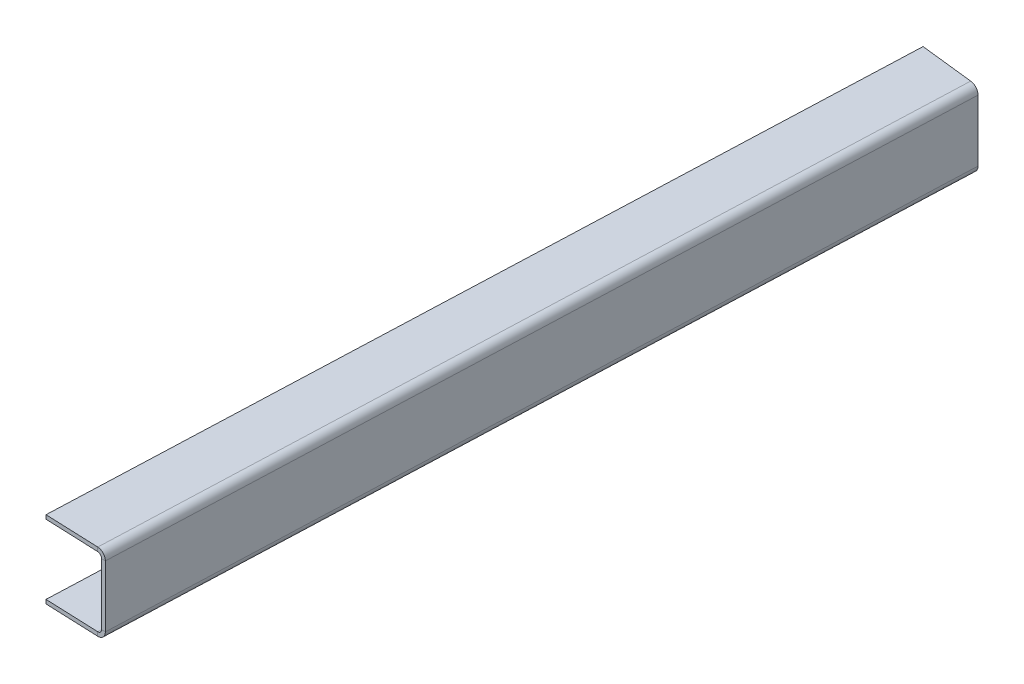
ISO-10303-21;
HEADER;
FILE_DESCRIPTION(('STEP AP214'),'2;1');
FILE_NAME('part.step','',(''),(''),'','','');
FILE_SCHEMA(('AUTOMOTIVE_DESIGN { 1 0 10303 214 1 1 1 1 }'));
ENDSEC;
DATA;
#1=APPLICATION_CONTEXT('core data for automotive mechanical design processes');
#2=APPLICATION_PROTOCOL_DEFINITION('international standard','automotive_design',2000,#1);
#3=PRODUCT_CONTEXT('',#1,'mechanical');
#4=PRODUCT('Part','Part','',(#3));
#5=PRODUCT_RELATED_PRODUCT_CATEGORY('part','',(#4));
#6=PRODUCT_DEFINITION_FORMATION('','',#4);
#7=PRODUCT_DEFINITION_CONTEXT('part definition',#1,'design');
#8=PRODUCT_DEFINITION('design','',#6,#7);
#9=PRODUCT_DEFINITION_SHAPE('','',#8);
#10=(LENGTH_UNIT() NAMED_UNIT(*) SI_UNIT(.MILLI.,.METRE.));
#11=(NAMED_UNIT(*) PLANE_ANGLE_UNIT() SI_UNIT($,.RADIAN.));
#12=(NAMED_UNIT(*) SI_UNIT($,.STERADIAN.) SOLID_ANGLE_UNIT());
#13=UNCERTAINTY_MEASURE_WITH_UNIT(LENGTH_MEASURE(1.E-05),#10,'distance_accuracy_value','');
#14=(GEOMETRIC_REPRESENTATION_CONTEXT(3) GLOBAL_UNCERTAINTY_ASSIGNED_CONTEXT((#13)) GLOBAL_UNIT_ASSIGNED_CONTEXT((#10,
#11,#12)) REPRESENTATION_CONTEXT('',''));
#15=CARTESIAN_POINT('',(0.,0.,0.));
#16=DIRECTION('',(0.,0.,1.));
#17=DIRECTION('',(1.,0.,0.));
#18=AXIS2_PLACEMENT_3D('',#15,#16,#17);
#19=CARTESIAN_POINT('',(1677.65806486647,-4.76152653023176E-13,-594.477985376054));
#20=DIRECTION('',(0.0392134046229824,0.,-0.999230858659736));
#21=DIRECTION('',(0.,1.,0.));
#22=AXIS2_PLACEMENT_3D('',#19,#20,#21);
#23=PLANE('',#22);
#24=DIRECTION('',(-0.999230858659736,0.,-0.0392134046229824));
#25=VECTOR('',#24,1.);
#26=CARTESIAN_POINT('',(1677.65806486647,-28.4988000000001,-594.477985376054));
#27=LINE('',#26,#25);
#28=CARTESIAN_POINT('',(1679.2824145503,-28.4988000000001,-594.414240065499));
#29=VERTEX_POINT('',#28);
#30=CARTESIAN_POINT('',(1677.65806486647,-28.4988000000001,-594.477985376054));
#31=VERTEX_POINT('',#30);
#32=EDGE_CURVE('E12',#29,#31,#27,.T.);
#33=ORIENTED_EDGE('',*,*,#32,.F.);
#34=DIRECTION('',(0.,1.,0.));
#35=VECTOR('',#34,1.);
#36=CARTESIAN_POINT('',(1679.2824145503,-4.76726766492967E-13,-594.414240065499));
#37=LINE('',#36,#35);
#38=CARTESIAN_POINT('',(1679.2824145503,-3.25120000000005,-594.414240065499));
#39=VERTEX_POINT('',#38);
#40=EDGE_CURVE('E137',#29,#39,#37,.T.);
#41=ORIENTED_EDGE('',*,*,#40,.T.);
#42=DIRECTION('',(-0.999230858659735,0.,-0.0392134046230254));
#43=VECTOR('',#42,1.);
#44=CARTESIAN_POINT('',(1677.65806486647,-3.25120000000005,-594.477985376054));
#45=LINE('',#44,#43);
#46=CARTESIAN_POINT('',(1677.65806486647,-3.25120000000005,-594.477985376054));
#47=VERTEX_POINT('',#46);
#48=EDGE_CURVE('E90',#39,#47,#45,.T.);
#49=ORIENTED_EDGE('',*,*,#48,.T.);
#50=DIRECTION('',(0.,1.,0.));
#51=VECTOR('',#50,1.);
#52=CARTESIAN_POINT('',(1677.65806486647,-4.76152653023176E-13,-594.477985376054));
#53=LINE('',#52,#51);
#54=EDGE_CURVE('E139',#31,#47,#53,.T.);
#55=ORIENTED_EDGE('',*,*,#54,.F.);
#56=EDGE_LOOP('',(#33,#41,#49,#55));
#57=FACE_BOUND('',#56,.T.);
#58=ADVANCED_FACE('F78',(#57),#23,.F.);
#59=CARTESIAN_POINT('',(1674.40943663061,-3.25120000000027,-594.607288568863));
#60=CARTESIAN_POINT('',(1673.867986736,-3.25120000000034,-594.628537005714));
#61=CARTESIAN_POINT('',(1673.32653684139,-3.25120000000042,-594.649785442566));
#62=CARTESIAN_POINT('',(1672.78508694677,-3.25120000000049,-594.671033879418));
#63=CARTESIAN_POINT('',(1674.40943663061,-6.50240000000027,-594.607288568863));
#64=CARTESIAN_POINT('',(1673.867986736,-7.58613333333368,-594.628537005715));
#65=CARTESIAN_POINT('',(1673.32653684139,-8.66986666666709,-594.649785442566));
#66=CARTESIAN_POINT('',(1672.78508694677,-9.75360000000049,-594.671033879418));
#67=CARTESIAN_POINT('',(1677.65806486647,-6.50239999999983,-594.477985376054));
#68=CARTESIAN_POINT('',(1678.19951476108,-7.5861333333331,-594.456736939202));
#69=CARTESIAN_POINT('',(1678.74096465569,-8.66986666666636,-594.435488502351));
#70=CARTESIAN_POINT('',(1679.28241455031,-9.75359999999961,-594.414240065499));
#71=CARTESIAN_POINT('',(1677.65806486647,-3.25119999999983,-594.477985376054));
#72=CARTESIAN_POINT('',(1678.19951476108,-3.25119999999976,-594.456736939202));
#73=CARTESIAN_POINT('',(1678.74096465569,-3.25119999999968,-594.435488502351));
#74=CARTESIAN_POINT('',(1679.2824145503,-3.25119999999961,-594.414240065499));
#75=CARTESIAN_POINT('',(1677.65806486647,1.70436581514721E-13,-594.477985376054));
#76=CARTESIAN_POINT('',(1678.19951476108,1.08373333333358,-594.456736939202));
#77=CARTESIAN_POINT('',(1678.74096465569,2.16746666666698,-594.435488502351));
#78=CARTESIAN_POINT('',(1679.2824145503,3.25120000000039,-594.414240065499));
#79=CARTESIAN_POINT('',(1674.40943663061,-2.69315819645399E-13,-594.607288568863));
#80=CARTESIAN_POINT('',(1673.867986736,1.08373333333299,-594.628537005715));
#81=CARTESIAN_POINT('',(1673.32653684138,2.16746666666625,-594.649785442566));
#82=CARTESIAN_POINT('',(1672.78508694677,3.25119999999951,-594.671033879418));
#83=CARTESIAN_POINT('',(1674.40943663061,-3.25120000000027,-594.607288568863));
#84=CARTESIAN_POINT('',(1673.867986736,-3.25120000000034,-594.628537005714));
#85=CARTESIAN_POINT('',(1673.32653684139,-3.25120000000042,-594.649785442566));
#86=CARTESIAN_POINT('',(1672.78508694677,-3.25120000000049,-594.671033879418));
#87=(BOUNDED_SURFACE() B_SPLINE_SURFACE(3,3,((#59,#60,#61,#62),(#63,#64,#65,#66),(#67,#68,#69,
#70),(#71,#72,#73,#74),(#75,#76,#77,#78),(#79,#80,#81,#82),(#83,#84,#85,#86)),.UNSPECIFIED.,.T.,
.F.,.F.) B_SPLINE_SURFACE_WITH_KNOTS((4,3,4),(4,4),(0.,0.5,1.),(0.,1.),
.UNSPECIFIED.) GEOMETRIC_REPRESENTATION_ITEM() RATIONAL_B_SPLINE_SURFACE(((1.,1.,1.,1.),
(0.333333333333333,0.333333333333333,0.333333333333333,0.333333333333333),(0.333333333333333,
0.333333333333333,0.333333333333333,0.333333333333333),(1.,1.,1.,1.),(0.333333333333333,
0.333333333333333,0.333333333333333,0.333333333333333),(0.333333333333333,0.333333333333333,
0.333333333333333,0.333333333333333),(1.,1.,1.,1.))) REPRESENTATION_ITEM('') SURFACE());
#88=CARTESIAN_POINT('',(1676.03375074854,-3.25120000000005,-594.542636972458));
#89=DIRECTION('',(-0.0394921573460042,0.,0.999219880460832));
#90=DIRECTION('',(-0.999219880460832,-1.35258484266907E-13,-0.0394921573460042));
#91=AXIS2_PLACEMENT_3D('',#88,#89,#90);
#92=ELLIPSE('',#91,3.25120012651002,3.2512);
#93=CARTESIAN_POINT('',(1676.03375074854,0.,-594.542636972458));
#94=VERTEX_POINT('',#93);
#95=EDGE_CURVE('E215',#39,#94,#92,.T.);
#96=DIRECTION('',(0.,-1.,0.));
#97=VECTOR('',#96,1.);
#98=CARTESIAN_POINT('',(1676.03375074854,-1.62560000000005,-594.542636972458));
#99=LINE('',#98,#97);
#100=CARTESIAN_POINT('',(1676.03375074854,-1.62560000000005,-594.542636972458));
#101=VERTEX_POINT('',#100);
#102=EDGE_CURVE('E205',#94,#101,#99,.T.);
#103=CARTESIAN_POINT('',(1676.03375074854,-3.25120000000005,-594.542636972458));
#104=DIRECTION('',(-0.0397709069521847,0.,0.999208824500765));
#105=DIRECTION('',(-0.999208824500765,-1.35321803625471E-13,-0.0397709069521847));
#106=AXIS2_PLACEMENT_3D('',#103,#104,#105);
#107=ELLIPSE('',#106,1.62560025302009,1.6256);
#108=EDGE_CURVE('E213',#47,#101,#107,.T.);
#109=ORIENTED_EDGE('',*,*,#48,.F.);
#110=ORIENTED_EDGE('',*,*,#95,.T.);
#111=ORIENTED_EDGE('',*,*,#102,.T.);
#112=ORIENTED_EDGE('',*,*,#108,.F.);
#113=EDGE_LOOP('',(#109,#110,#111,#112));
#114=FACE_BOUND('',#113,.T.);
#115=ADVANCED_FACE('F212',(#114),#87,.F.);
#116=CARTESIAN_POINT('',(1653.89808023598,-1.62560000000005,-595.423689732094));
#117=DIRECTION('',(-0.0397709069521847,0.,0.999208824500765));
#118=DIRECTION('',(0.999208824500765,0.,0.0397709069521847));
#119=AXIS2_PLACEMENT_3D('',#116,#117,#118);
#120=PLANE('',#119);
#121=ORIENTED_EDGE('',*,*,#102,.F.);
#122=DIRECTION('',(0.999208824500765,0.,0.0397709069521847));
#123=VECTOR('',#122,1.);
#124=CARTESIAN_POINT('',(1653.89808023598,0.,-595.423689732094));
#125=LINE('',#124,#123);
#126=CARTESIAN_POINT('',(1653.89808023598,0.,-595.423689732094));
#127=VERTEX_POINT('',#126);
#128=EDGE_CURVE('E176',#127,#94,#125,.T.);
#129=ORIENTED_EDGE('',*,*,#128,.F.);
#130=DIRECTION('',(0.,-1.,0.));
#131=VECTOR('',#130,1.);
#132=CARTESIAN_POINT('',(1653.89808023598,-1.62560000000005,-595.423689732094));
#133=LINE('',#132,#131);
#134=CARTESIAN_POINT('',(1653.89808023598,-1.62560000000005,-595.423689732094));
#135=VERTEX_POINT('',#134);
#136=EDGE_CURVE('E202',#127,#135,#133,.T.);
#137=ORIENTED_EDGE('',*,*,#136,.T.);
#138=DIRECTION('',(0.999208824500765,0.,0.0397709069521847));
#139=VECTOR('',#138,1.);
#140=CARTESIAN_POINT('',(1653.89808023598,-1.62560000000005,-595.423689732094));
#141=LINE('',#140,#139);
#142=EDGE_CURVE('E232',#135,#101,#141,.T.);
#143=ORIENTED_EDGE('',*,*,#142,.T.);
#144=EDGE_LOOP('',(#121,#129,#137,#143));
#145=FACE_BOUND('',#144,.T.);
#146=ADVANCED_FACE('F233',(#145),#120,.T.);
#147=CARTESIAN_POINT('',(1667.50578030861,-1.62560000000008,-942.173326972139));
#148=DIRECTION('',(-0.999230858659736,0.,-0.0392134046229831));
#149=DIRECTION('',(-0.0392134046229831,0.,0.999230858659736));
#150=AXIS2_PLACEMENT_3D('',#147,#148,#149);
#151=PLANE('',#150);
#152=ORIENTED_EDGE('',*,*,#136,.F.);
#153=DIRECTION('',(-0.0392134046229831,0.,0.999230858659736));
#154=VECTOR('',#153,1.);
#155=CARTESIAN_POINT('',(1667.50578030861,0.,-942.173326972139));
#156=LINE('',#155,#154);
#157=CARTESIAN_POINT('',(1667.50578030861,0.,-942.173326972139));
#158=VERTEX_POINT('',#157);
#159=EDGE_CURVE('E168',#158,#127,#156,.T.);
#160=ORIENTED_EDGE('',*,*,#159,.F.);
#161=DIRECTION('',(0.,-1.,0.));
#162=VECTOR('',#161,1.);
#163=CARTESIAN_POINT('',(1667.50578030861,-1.62560000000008,-942.173326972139));
#164=LINE('',#163,#162);
#165=CARTESIAN_POINT('',(1667.50578030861,-1.62560000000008,-942.173326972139));
#166=VERTEX_POINT('',#165);
#167=EDGE_CURVE('E199',#158,#166,#164,.T.);
#168=ORIENTED_EDGE('',*,*,#167,.T.);
#169=DIRECTION('',(-0.0392134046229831,0.,0.999230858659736));
#170=VECTOR('',#169,1.);
#171=CARTESIAN_POINT('',(1667.50578030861,-1.62560000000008,-942.173326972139));
#172=LINE('',#171,#170);
#173=EDGE_CURVE('E237',#166,#135,#172,.T.);
#174=ORIENTED_EDGE('',*,*,#173,.T.);
#175=EDGE_LOOP('',(#152,#160,#168,#174));
#176=FACE_BOUND('',#175,.T.);
#177=ADVANCED_FACE('F280',(#176),#151,.T.);
#178=CARTESIAN_POINT('',(1692.8128612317,-1.62560000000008,-939.30737334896));
#179=DIRECTION('',(0.112527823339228,0.,-0.993648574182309));
#180=DIRECTION('',(-0.993648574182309,0.,-0.112527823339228));
#181=AXIS2_PLACEMENT_3D('',#178,#179,#180);
#182=PLANE('',#181);
#183=ORIENTED_EDGE('',*,*,#167,.F.);
#184=DIRECTION('',(-0.993648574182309,0.,-0.112527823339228));
#185=VECTOR('',#184,1.);
#186=CARTESIAN_POINT('',(1692.8128612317,0.,-939.30737334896));
#187=LINE('',#186,#185);
#188=CARTESIAN_POINT('',(1689.57793293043,0.,-939.673719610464));
#189=VERTEX_POINT('',#188);
#190=EDGE_CURVE('E173',#189,#158,#187,.T.);
#191=ORIENTED_EDGE('',*,*,#190,.F.);
#192=DIRECTION('',(0.,-1.,0.));
#193=VECTOR('',#192,1.);
#194=CARTESIAN_POINT('',(1689.57793293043,-1.62560000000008,-939.673719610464));
#195=LINE('',#194,#193);
#196=CARTESIAN_POINT('',(1689.57793293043,-1.62560000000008,-939.673719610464));
#197=VERTEX_POINT('',#196);
#198=EDGE_CURVE('E196',#189,#197,#195,.T.);
#199=ORIENTED_EDGE('',*,*,#198,.T.);
#200=DIRECTION('',(-0.993648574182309,0.,-0.112527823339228));
#201=VECTOR('',#200,1.);
#202=CARTESIAN_POINT('',(1692.8128612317,-1.62560000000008,-939.30737334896));
#203=LINE('',#202,#201);
#204=EDGE_CURVE('E238',#197,#166,#203,.T.);
#205=ORIENTED_EDGE('',*,*,#204,.T.);
#206=EDGE_LOOP('',(#183,#191,#199,#205));
#207=FACE_BOUND('',#206,.T.);
#208=ADVANCED_FACE('F307',(#207),#182,.T.);
#209=CARTESIAN_POINT('',(1687.95827975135,-3.25120000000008,-939.857140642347));
#210=CARTESIAN_POINT('',(1687.41682985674,-3.25120000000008,-939.878389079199));
#211=CARTESIAN_POINT('',(1686.87537996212,-3.25120000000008,-939.899637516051));
#212=CARTESIAN_POINT('',(1686.33393006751,-3.25120000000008,-939.920885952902));
#213=CARTESIAN_POINT('',(1687.95827975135,0.,-939.857140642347));
#214=CARTESIAN_POINT('',(1687.41682985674,1.08373333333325,-939.878389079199));
#215=CARTESIAN_POINT('',(1686.87537996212,2.16746666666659,-939.899637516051));
#216=CARTESIAN_POINT('',(1686.33393006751,3.25119999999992,-939.920885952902));
#217=CARTESIAN_POINT('',(1691.1975861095,0.,-939.49029857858));
#218=CARTESIAN_POINT('',(1691.73903600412,1.08373333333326,-939.469050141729));
#219=CARTESIAN_POINT('',(1692.28048589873,2.16746666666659,-939.447801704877));
#220=CARTESIAN_POINT('',(1692.82193579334,3.25119999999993,-939.426553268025));
#221=CARTESIAN_POINT('',(1691.1975861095,-3.25120000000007,-939.49029857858));
#222=CARTESIAN_POINT('',(1691.73903600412,-3.25120000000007,-939.469050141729));
#223=CARTESIAN_POINT('',(1692.28048589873,-3.25120000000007,-939.447801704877));
#224=CARTESIAN_POINT('',(1692.82193579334,-3.25120000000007,-939.426553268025));
#225=CARTESIAN_POINT('',(1691.1975861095,-6.50240000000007,-939.49029857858));
#226=CARTESIAN_POINT('',(1691.73903600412,-7.58613333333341,-939.469050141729));
#227=CARTESIAN_POINT('',(1692.28048589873,-8.66986666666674,-939.447801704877));
#228=CARTESIAN_POINT('',(1692.82193579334,-9.75360000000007,-939.426553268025));
#229=CARTESIAN_POINT('',(1687.95827975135,-6.50240000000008,-939.857140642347));
#230=CARTESIAN_POINT('',(1687.41682985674,-7.58613333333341,-939.878389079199));
#231=CARTESIAN_POINT('',(1686.87537996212,-8.66986666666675,-939.899637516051));
#232=CARTESIAN_POINT('',(1686.33393006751,-9.75360000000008,-939.920885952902));
#233=CARTESIAN_POINT('',(1687.95827975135,-3.25120000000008,-939.857140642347));
#234=CARTESIAN_POINT('',(1687.41682985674,-3.25120000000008,-939.878389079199));
#235=CARTESIAN_POINT('',(1686.87537996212,-3.25120000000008,-939.899637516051));
#236=CARTESIAN_POINT('',(1686.33393006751,-3.25120000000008,-939.920885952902));
#237=(BOUNDED_SURFACE() B_SPLINE_SURFACE(3,3,((#209,#210,#211,#212),(#213,#214,#215,#216),(#217,
#218,#219,#220),(#221,#222,#223,#224),(#225,#226,#227,#228),(#229,#230,#231,#232),(#233,#234,
#235,#236)),.UNSPECIFIED.,.T.,.F.,.F.) B_SPLINE_SURFACE_WITH_KNOTS((4,3,4),(4,4),(0.,0.5,1.),
(0.,1.),.UNSPECIFIED.) GEOMETRIC_REPRESENTATION_ITEM() RATIONAL_B_SPLINE_SURFACE(((1.,1.,1.,1.),
(0.333333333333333,0.333333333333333,0.333333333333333,0.333333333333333),(0.333333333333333,
0.333333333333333,0.333333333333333,0.333333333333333),(1.,1.,1.,1.),(0.333333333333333,
0.333333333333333,0.333333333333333,0.333333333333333),(0.333333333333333,0.333333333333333,
0.333333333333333,0.333333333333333),(1.,1.,1.,1.))) REPRESENTATION_ITEM('') SURFACE());
#238=CARTESIAN_POINT('',(1689.57793293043,-3.25120000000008,-939.673719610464));
#239=DIRECTION('',(0.0759715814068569,0.,-0.997109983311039));
#240=DIRECTION('',(-0.997109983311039,0.,-0.0759715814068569));
#241=AXIS2_PLACEMENT_3D('',#238,#239,#240);
#242=ELLIPSE('',#241,3.25340525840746,3.2512);
#243=CARTESIAN_POINT('',(1692.82193579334,-3.25120000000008,-939.426553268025));
#244=VERTEX_POINT('',#243);
#245=EDGE_CURVE('E178',#189,#244,#242,.T.);
#246=DIRECTION('',(-0.999230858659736,0.,-0.0392134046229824));
#247=VECTOR('',#246,1.);
#248=CARTESIAN_POINT('',(1691.1975861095,-3.25120000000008,-939.49029857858));
#249=LINE('',#248,#247);
#250=CARTESIAN_POINT('',(1691.1975861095,-3.25120000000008,-939.49029857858));
#251=VERTEX_POINT('',#250);
#252=EDGE_CURVE('E194',#244,#251,#249,.T.);
#253=CARTESIAN_POINT('',(1689.57793293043,-3.25120000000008,-939.673719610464));
#254=DIRECTION('',(0.112527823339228,0.,-0.993648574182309));
#255=DIRECTION('',(-0.993648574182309,0.,-0.112527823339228));
#256=AXIS2_PLACEMENT_3D('',#253,#254,#255);
#257=ELLIPSE('',#256,1.63000604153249,1.6256);
#258=EDGE_CURVE('E229',#197,#251,#257,.T.);
#259=ORIENTED_EDGE('',*,*,#198,.F.);
#260=ORIENTED_EDGE('',*,*,#245,.T.);
#261=ORIENTED_EDGE('',*,*,#252,.T.);
#262=ORIENTED_EDGE('',*,*,#258,.F.);
#263=EDGE_LOOP('',(#259,#260,#261,#262));
#264=FACE_BOUND('',#263,.T.);
#265=ADVANCED_FACE('F357',(#264),#237,.F.);
#266=CARTESIAN_POINT('',(1691.1975861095,-4.54366063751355E-13,-939.49029857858));
#267=DIRECTION('',(-0.0392134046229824,0.,0.999230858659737));
#268=DIRECTION('',(0.,-1.,0.));
#269=AXIS2_PLACEMENT_3D('',#266,#267,#268);
#270=PLANE('',#269);
#271=ORIENTED_EDGE('',*,*,#252,.F.);
#272=DIRECTION('',(0.,1.,0.));
#273=VECTOR('',#272,1.);
#274=CARTESIAN_POINT('',(1692.82193579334,-4.76726766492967E-13,-939.426553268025));
#275=LINE('',#274,#273);
#276=CARTESIAN_POINT('',(1692.82193579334,-28.4988000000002,-939.426553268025));
#277=VERTEX_POINT('',#276);
#278=EDGE_CURVE('E167',#244,#277,#275,.F.);
#279=ORIENTED_EDGE('',*,*,#278,.T.);
#280=DIRECTION('',(-0.999230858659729,0.,-0.0392134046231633));
#281=VECTOR('',#280,1.);
#282=CARTESIAN_POINT('',(1691.1975861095,-28.4988000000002,-939.49029857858));
#283=LINE('',#282,#281);
#284=CARTESIAN_POINT('',(1691.1975861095,-28.4988000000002,-939.49029857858));
#285=VERTEX_POINT('',#284);
#286=EDGE_CURVE('E191',#277,#285,#283,.T.);
#287=ORIENTED_EDGE('',*,*,#286,.T.);
#288=DIRECTION('',(0.,-1.,0.));
#289=VECTOR('',#288,1.);
#290=CARTESIAN_POINT('',(1691.1975861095,-4.54366063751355E-13,-939.49029857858));
#291=LINE('',#290,#289);
#292=EDGE_CURVE('E284',#251,#285,#291,.T.);
#293=ORIENTED_EDGE('',*,*,#292,.F.);
#294=EDGE_LOOP('',(#271,#279,#287,#293));
#295=FACE_BOUND('',#294,.T.);
#296=ADVANCED_FACE('F322',(#295),#270,.F.);
#297=CARTESIAN_POINT('',(1691.1975861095,-28.4988000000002,-939.490298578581));
#298=CARTESIAN_POINT('',(1691.73903600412,-28.4988000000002,-939.469050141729));
#299=CARTESIAN_POINT('',(1692.28048589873,-28.4988000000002,-939.447801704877));
#300=CARTESIAN_POINT('',(1692.82193579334,-28.4988000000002,-939.426553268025));
#301=CARTESIAN_POINT('',(1691.1975861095,-31.7500000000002,-939.490298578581));
#302=CARTESIAN_POINT('',(1691.73903600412,-32.8337333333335,-939.469050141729));
#303=CARTESIAN_POINT('',(1692.28048589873,-33.9174666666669,-939.447801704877));
#304=CARTESIAN_POINT('',(1692.82193579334,-35.0012000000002,-939.426553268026));
#305=CARTESIAN_POINT('',(1687.95827975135,-31.7500000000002,-939.857140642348));
#306=CARTESIAN_POINT('',(1687.41682985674,-32.8337333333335,-939.8783890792));
#307=CARTESIAN_POINT('',(1686.87537996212,-33.9174666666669,-939.899637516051));
#308=CARTESIAN_POINT('',(1686.33393006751,-35.0012000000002,-939.920885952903));
#309=CARTESIAN_POINT('',(1687.95827975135,-28.4988000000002,-939.857140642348));
#310=CARTESIAN_POINT('',(1687.41682985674,-28.4988000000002,-939.8783890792));
#311=CARTESIAN_POINT('',(1686.87537996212,-28.4988000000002,-939.899637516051));
#312=CARTESIAN_POINT('',(1686.33393006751,-28.4988000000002,-939.920885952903));
#313=CARTESIAN_POINT('',(1687.95827975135,-25.2476000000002,-939.857140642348));
#314=CARTESIAN_POINT('',(1687.41682985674,-24.1638666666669,-939.8783890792));
#315=CARTESIAN_POINT('',(1686.87537996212,-23.0801333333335,-939.899637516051));
#316=CARTESIAN_POINT('',(1686.33393006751,-21.9964000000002,-939.920885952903));
#317=CARTESIAN_POINT('',(1691.1975861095,-25.2476000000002,-939.490298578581));
#318=CARTESIAN_POINT('',(1691.73903600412,-24.1638666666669,-939.469050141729));
#319=CARTESIAN_POINT('',(1692.28048589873,-23.0801333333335,-939.447801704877));
#320=CARTESIAN_POINT('',(1692.82193579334,-21.9964000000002,-939.426553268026));
#321=CARTESIAN_POINT('',(1691.1975861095,-28.4988000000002,-939.490298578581));
#322=CARTESIAN_POINT('',(1691.73903600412,-28.4988000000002,-939.469050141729));
#323=CARTESIAN_POINT('',(1692.28048589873,-28.4988000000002,-939.447801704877));
#324=CARTESIAN_POINT('',(1692.82193579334,-28.4988000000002,-939.426553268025));
#325=(BOUNDED_SURFACE() B_SPLINE_SURFACE(3,3,((#297,#298,#299,#300),(#301,#302,#303,#304),(#305,
#306,#307,#308),(#309,#310,#311,#312),(#313,#314,#315,#316),(#317,#318,#319,#320),(#321,#322,
#323,#324)),.UNSPECIFIED.,.T.,.F.,.F.) B_SPLINE_SURFACE_WITH_KNOTS((4,3,4),(4,4),(0.,0.5,1.),
(0.,1.),.UNSPECIFIED.) GEOMETRIC_REPRESENTATION_ITEM() RATIONAL_B_SPLINE_SURFACE(((1.,1.,1.,1.),
(0.333333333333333,0.333333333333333,0.333333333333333,0.333333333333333),(0.333333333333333,
0.333333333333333,0.333333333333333,0.333333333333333),(1.,1.,1.,1.),(0.333333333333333,
0.333333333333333,0.333333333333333,0.333333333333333),(0.333333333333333,0.333333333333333,
0.333333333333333,0.333333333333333),(1.,1.,1.,1.))) REPRESENTATION_ITEM('') SURFACE());
#326=CARTESIAN_POINT('',(1689.57793293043,-28.4988000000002,-939.673719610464));
#327=DIRECTION('',(0.0759715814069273,0.,-0.997109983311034));
#328=DIRECTION('',(0.997109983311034,0.,0.0759715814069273));
#329=AXIS2_PLACEMENT_3D('',#326,#327,#328);
#330=ELLIPSE('',#329,3.25340525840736,3.2512);
#331=CARTESIAN_POINT('',(1689.57793293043,-31.7500000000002,-939.673719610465));
#332=VERTEX_POINT('',#331);
#333=EDGE_CURVE('E155',#277,#332,#330,.T.);
#334=DIRECTION('',(0.,1.,0.));
#335=VECTOR('',#334,1.);
#336=CARTESIAN_POINT('',(1689.57793293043,-30.1244000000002,-939.673719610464));
#337=LINE('',#336,#335);
#338=CARTESIAN_POINT('',(1689.57793293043,-30.1244000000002,-939.673719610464));
#339=VERTEX_POINT('',#338);
#340=EDGE_CURVE('E188',#332,#339,#337,.T.);
#341=CARTESIAN_POINT('',(1689.57793293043,-28.4988000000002,-939.673719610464));
#342=DIRECTION('',(0.112527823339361,0.,-0.993648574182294));
#343=DIRECTION('',(0.993648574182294,0.,0.112527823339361));
#344=AXIS2_PLACEMENT_3D('',#341,#342,#343);
#345=ELLIPSE('',#344,1.6300060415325,1.6256);
#346=EDGE_CURVE('E254',#285,#339,#345,.T.);
#347=ORIENTED_EDGE('',*,*,#286,.F.);
#348=ORIENTED_EDGE('',*,*,#333,.T.);
#349=ORIENTED_EDGE('',*,*,#340,.T.);
#350=ORIENTED_EDGE('',*,*,#346,.F.);
#351=EDGE_LOOP('',(#347,#348,#349,#350));
#352=FACE_BOUND('',#351,.T.);
#353=ADVANCED_FACE('F326',(#352),#325,.F.);
#354=CARTESIAN_POINT('',(1667.50578030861,-30.1244000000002,-942.173326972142));
#355=DIRECTION('',(0.112527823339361,0.,-0.993648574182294));
#356=DIRECTION('',(0.993648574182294,0.,0.112527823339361));
#357=AXIS2_PLACEMENT_3D('',#354,#355,#356);
#358=PLANE('',#357);
#359=ORIENTED_EDGE('',*,*,#340,.F.);
#360=DIRECTION('',(0.993648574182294,0.,0.112527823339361));
#361=VECTOR('',#360,1.);
#362=CARTESIAN_POINT('',(1667.50578030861,-31.7500000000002,-942.173326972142));
#363=LINE('',#362,#361);
#364=CARTESIAN_POINT('',(1667.50578030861,-31.7500000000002,-942.173326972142));
#365=VERTEX_POINT('',#364);
#366=EDGE_CURVE('E262',#365,#332,#363,.T.);
#367=ORIENTED_EDGE('',*,*,#366,.F.);
#368=DIRECTION('',(0.,1.,0.));
#369=VECTOR('',#368,1.);
#370=CARTESIAN_POINT('',(1667.50578030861,-30.1244000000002,-942.173326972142));
#371=LINE('',#370,#369);
#372=CARTESIAN_POINT('',(1667.50578030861,-30.1244000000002,-942.173326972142));
#373=VERTEX_POINT('',#372);
#374=EDGE_CURVE('E185',#365,#373,#371,.T.);
#375=ORIENTED_EDGE('',*,*,#374,.T.);
#376=DIRECTION('',(0.993648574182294,0.,0.112527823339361));
#377=VECTOR('',#376,1.);
#378=CARTESIAN_POINT('',(1667.50578030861,-30.1244000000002,-942.173326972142));
#379=LINE('',#378,#377);
#380=EDGE_CURVE('E293',#373,#339,#379,.T.);
#381=ORIENTED_EDGE('',*,*,#380,.T.);
#382=EDGE_LOOP('',(#359,#367,#375,#381));
#383=FACE_BOUND('',#382,.T.);
#384=ADVANCED_FACE('F374',(#383),#358,.T.);
#385=CARTESIAN_POINT('',(1653.89808023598,-30.1244000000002,-595.423689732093));
#386=DIRECTION('',(-0.999230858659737,0.,-0.0392134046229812));
#387=DIRECTION('',(0.0392134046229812,0.,-0.999230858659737));
#388=AXIS2_PLACEMENT_3D('',#385,#386,#387);
#389=PLANE('',#388);
#390=ORIENTED_EDGE('',*,*,#374,.F.);
#391=DIRECTION('',(0.0392134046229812,0.,-0.999230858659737));
#392=VECTOR('',#391,1.);
#393=CARTESIAN_POINT('',(1653.89808023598,-31.7500000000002,-595.423689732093));
#394=LINE('',#393,#392);
#395=CARTESIAN_POINT('',(1653.89808023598,-31.7500000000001,-595.423689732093));
#396=VERTEX_POINT('',#395);
#397=EDGE_CURVE('E255',#396,#365,#394,.T.);
#398=ORIENTED_EDGE('',*,*,#397,.F.);
#399=DIRECTION('',(0.,1.,0.));
#400=VECTOR('',#399,1.);
#401=CARTESIAN_POINT('',(1653.89808023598,-30.1244000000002,-595.423689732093));
#402=LINE('',#401,#400);
#403=CARTESIAN_POINT('',(1653.89808023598,-30.1244000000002,-595.423689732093));
#404=VERTEX_POINT('',#403);
#405=EDGE_CURVE('E182',#396,#404,#402,.T.);
#406=ORIENTED_EDGE('',*,*,#405,.T.);
#407=DIRECTION('',(0.0392134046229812,0.,-0.999230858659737));
#408=VECTOR('',#407,1.);
#409=CARTESIAN_POINT('',(1653.89808023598,-30.1244000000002,-595.423689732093));
#410=LINE('',#409,#408);
#411=EDGE_CURVE('E296',#404,#373,#410,.T.);
#412=ORIENTED_EDGE('',*,*,#411,.T.);
#413=EDGE_LOOP('',(#390,#398,#406,#412));
#414=FACE_BOUND('',#413,.T.);
#415=ADVANCED_FACE('F382',(#414),#389,.T.);
#416=CARTESIAN_POINT('',(1679.27798832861,-30.1244000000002,-594.413508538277));
#417=DIRECTION('',(-0.0397709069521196,0.,0.999208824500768));
#418=DIRECTION('',(-0.999208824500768,0.,-0.0397709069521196));
#419=AXIS2_PLACEMENT_3D('',#416,#417,#418);
#420=PLANE('',#419);
#421=ORIENTED_EDGE('',*,*,#405,.F.);
#422=DIRECTION('',(-0.999208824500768,0.,-0.0397709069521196));
#423=VECTOR('',#422,1.);
#424=CARTESIAN_POINT('',(1679.27798832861,-31.7500000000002,-594.413508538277));
#425=LINE('',#424,#423);
#426=CARTESIAN_POINT('',(1676.03375074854,-31.7500000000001,-594.542636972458));
#427=VERTEX_POINT('',#426);
#428=EDGE_CURVE('E259',#427,#396,#425,.T.);
#429=ORIENTED_EDGE('',*,*,#428,.F.);
#430=DIRECTION('',(0.,1.,-1.36592399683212E-13));
#431=VECTOR('',#430,1.);
#432=CARTESIAN_POINT('',(1676.03375074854,-30.1244000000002,-594.542636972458));
#433=LINE('',#432,#431);
#434=CARTESIAN_POINT('',(1676.03375074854,-30.1244000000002,-594.542636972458));
#435=VERTEX_POINT('',#434);
#436=EDGE_CURVE('E84',#427,#435,#433,.T.);
#437=ORIENTED_EDGE('',*,*,#436,.T.);
#438=DIRECTION('',(-0.999208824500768,0.,-0.0397709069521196));
#439=VECTOR('',#438,1.);
#440=CARTESIAN_POINT('',(1679.27798832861,-30.1244000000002,-594.413508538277));
#441=LINE('',#440,#439);
#442=EDGE_CURVE('E290',#435,#404,#441,.T.);
#443=ORIENTED_EDGE('',*,*,#442,.T.);
#444=EDGE_LOOP('',(#421,#429,#437,#443));
#445=FACE_BOUND('',#444,.T.);
#446=ADVANCED_FACE('F386',(#445),#420,.T.);
#447=CARTESIAN_POINT('',(1677.65806486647,-28.4987999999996,-594.477985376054));
#448=CARTESIAN_POINT('',(1678.19951476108,-28.4987999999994,-594.456736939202));
#449=CARTESIAN_POINT('',(1678.74096465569,-28.4987999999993,-594.435488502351));
#450=CARTESIAN_POINT('',(1679.2824145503,-28.4987999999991,-594.414240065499));
#451=CARTESIAN_POINT('',(1677.65806486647,-25.2475999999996,-594.477985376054));
#452=CARTESIAN_POINT('',(1678.19951476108,-24.1638666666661,-594.456736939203));
#453=CARTESIAN_POINT('',(1678.74096465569,-23.0801333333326,-594.435488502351));
#454=CARTESIAN_POINT('',(1679.2824145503,-21.9963999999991,-594.414240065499));
#455=CARTESIAN_POINT('',(1674.40943663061,-25.2476000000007,-594.607288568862));
#456=CARTESIAN_POINT('',(1673.867986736,-24.1638666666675,-594.628537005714));
#457=CARTESIAN_POINT('',(1673.32653684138,-23.0801333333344,-594.649785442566));
#458=CARTESIAN_POINT('',(1672.78508694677,-21.9964000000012,-594.671033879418));
#459=CARTESIAN_POINT('',(1674.40943663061,-28.4988000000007,-594.607288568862));
#460=CARTESIAN_POINT('',(1673.867986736,-28.4988000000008,-594.628537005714));
#461=CARTESIAN_POINT('',(1673.32653684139,-28.498800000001,-594.649785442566));
#462=CARTESIAN_POINT('',(1672.78508694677,-28.4988000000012,-594.671033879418));
#463=CARTESIAN_POINT('',(1674.40943663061,-31.7500000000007,-594.607288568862));
#464=CARTESIAN_POINT('',(1673.867986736,-32.8337333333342,-594.628537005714));
#465=CARTESIAN_POINT('',(1673.32653684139,-33.9174666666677,-594.649785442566));
#466=CARTESIAN_POINT('',(1672.78508694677,-35.0012000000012,-594.671033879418));
#467=CARTESIAN_POINT('',(1677.65806486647,-31.7499999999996,-594.477985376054));
#468=CARTESIAN_POINT('',(1678.19951476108,-32.8337333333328,-594.456736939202));
#469=CARTESIAN_POINT('',(1678.74096465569,-33.9174666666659,-594.435488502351));
#470=CARTESIAN_POINT('',(1679.28241455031,-35.0011999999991,-594.414240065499));
#471=CARTESIAN_POINT('',(1677.65806486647,-28.4987999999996,-594.477985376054));
#472=CARTESIAN_POINT('',(1678.19951476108,-28.4987999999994,-594.456736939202));
#473=CARTESIAN_POINT('',(1678.74096465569,-28.4987999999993,-594.435488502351));
#474=CARTESIAN_POINT('',(1679.2824145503,-28.4987999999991,-594.414240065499));
#475=(BOUNDED_SURFACE() B_SPLINE_SURFACE(3,3,((#447,#448,#449,#450),(#451,#452,#453,#454),(#455,
#456,#457,#458),(#459,#460,#461,#462),(#463,#464,#465,#466),(#467,#468,#469,#470),(#471,#472,
#473,#474)),.UNSPECIFIED.,.T.,.F.,.F.) B_SPLINE_SURFACE_WITH_KNOTS((4,3,4),(4,4),(0.,0.5,1.),
(0.,1.),.UNSPECIFIED.) GEOMETRIC_REPRESENTATION_ITEM() RATIONAL_B_SPLINE_SURFACE(((1.,1.,1.,1.),
(0.333333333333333,0.333333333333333,0.333333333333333,0.333333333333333),(0.333333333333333,
0.333333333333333,0.333333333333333,0.333333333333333),(1.,1.,1.,1.),(0.333333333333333,
0.333333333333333,0.333333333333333,0.333333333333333),(0.333333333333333,0.333333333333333,
0.333333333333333,0.333333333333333),(1.,1.,1.,1.))) REPRESENTATION_ITEM('') SURFACE());
#476=CARTESIAN_POINT('',(1676.03375074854,-28.4988000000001,-594.542636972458));
#477=DIRECTION('',(-0.0394921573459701,0.,0.999219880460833));
#478=DIRECTION('',(0.999219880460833,3.24406936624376E-13,0.0394921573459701));
#479=AXIS2_PLACEMENT_3D('',#476,#477,#478);
#480=ELLIPSE('',#479,3.25120012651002,3.2512);
#481=EDGE_CURVE('E152',#427,#29,#480,.T.);
#482=CARTESIAN_POINT('',(1676.03375074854,-28.4988000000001,-594.542636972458));
#483=DIRECTION('',(-0.0397709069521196,0.,0.999208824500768));
#484=DIRECTION('',(0.999208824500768,3.2428549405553E-13,0.0397709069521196));
#485=AXIS2_PLACEMENT_3D('',#482,#483,#484);
#486=ELLIPSE('',#485,1.62560025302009,1.6256);
#487=EDGE_CURVE('E250',#435,#31,#486,.T.);
#488=ORIENTED_EDGE('',*,*,#481,.T.);
#489=ORIENTED_EDGE('',*,*,#32,.T.);
#490=ORIENTED_EDGE('',*,*,#487,.F.);
#491=ORIENTED_EDGE('',*,*,#436,.F.);
#492=EDGE_LOOP('',(#488,#489,#490,#491));
#493=FACE_BOUND('',#492,.T.);
#494=ADVANCED_FACE('F80',(#493),#475,.F.);
#495=CARTESIAN_POINT('',(0.,-30.1244,0.));
#496=DIRECTION('',(0.,-1.,0.));
#497=DIRECTION('',(0.,0.,-1.));
#498=AXIS2_PLACEMENT_3D('',#495,#496,#497);
#499=PLANE('',#498);
#500=ORIENTED_EDGE('',*,*,#442,.F.);
#501=DIRECTION('',(0.0392134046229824,0.,-0.999230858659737));
#502=VECTOR('',#501,1.);
#503=CARTESIAN_POINT('',(1689.57323642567,-30.1244000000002,-939.554043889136));
#504=LINE('',#503,#502);
#505=EDGE_CURVE('E247',#435,#339,#504,.T.);
#506=ORIENTED_EDGE('',*,*,#505,.T.);
#507=ORIENTED_EDGE('',*,*,#380,.F.);
#508=ORIENTED_EDGE('',*,*,#411,.F.);
#509=EDGE_LOOP('',(#500,#506,#507,#508));
#510=FACE_BOUND('',#509,.T.);
#511=ADVANCED_FACE('F411',(#510),#499,.F.);
#512=CARTESIAN_POINT('',(1651.78711095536,-4.76258652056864E-13,64.7622856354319));
#513=DIRECTION('',(0.999230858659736,0.,0.0392134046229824));
#514=DIRECTION('',(0.0392134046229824,0.,-0.999230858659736));
#515=AXIS2_PLACEMENT_3D('',#512,#513,#514);
#516=PLANE('',#515);
#517=ORIENTED_EDGE('',*,*,#54,.T.);
#518=DIRECTION('',(-0.0392134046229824,0.,0.999230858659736));
#519=VECTOR('',#518,1.);
#520=CARTESIAN_POINT('',(1691.1975861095,-3.25120000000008,-939.490298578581));
#521=LINE('',#520,#519);
#522=EDGE_CURVE('E228',#47,#251,#521,.F.);
#523=ORIENTED_EDGE('',*,*,#522,.T.);
#524=ORIENTED_EDGE('',*,*,#292,.T.);
#525=DIRECTION('',(0.0392134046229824,0.,-0.999230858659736));
#526=VECTOR('',#525,1.);
#527=CARTESIAN_POINT('',(1677.65806486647,-28.4988000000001,-594.477985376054));
#528=LINE('',#527,#526);
#529=EDGE_CURVE('E244',#285,#31,#528,.F.);
#530=ORIENTED_EDGE('',*,*,#529,.T.);
#531=EDGE_LOOP('',(#517,#523,#524,#530));
#532=FACE_BOUND('',#531,.T.);
#533=ADVANCED_FACE('F325',(#532),#516,.F.);
#534=CARTESIAN_POINT('',(0.,-1.6256,0.));
#535=DIRECTION('',(0.,1.,0.));
#536=DIRECTION('',(0.,0.,1.));
#537=AXIS2_PLACEMENT_3D('',#534,#535,#536);
#538=PLANE('',#537);
#539=ORIENTED_EDGE('',*,*,#204,.F.);
#540=DIRECTION('',(-0.0392134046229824,0.,0.999230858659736));
#541=VECTOR('',#540,1.);
#542=CARTESIAN_POINT('',(1676.03371518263,-1.62560000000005,-594.541730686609));
#543=LINE('',#542,#541);
#544=EDGE_CURVE('E226',#197,#101,#543,.T.);
#545=ORIENTED_EDGE('',*,*,#544,.T.);
#546=ORIENTED_EDGE('',*,*,#142,.F.);
#547=ORIENTED_EDGE('',*,*,#173,.F.);
#548=EDGE_LOOP('',(#539,#545,#546,#547));
#549=FACE_BOUND('',#548,.T.);
#550=ADVANCED_FACE('F241',(#549),#538,.F.);
#551=CARTESIAN_POINT('',(1650.16041936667,-28.4988,64.7582164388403));
#552=DIRECTION('',(-0.0392134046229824,0.,0.999230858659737));
#553=DIRECTION('',(0.999230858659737,0.,0.0392134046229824));
#554=AXIS2_PLACEMENT_3D('',#551,#552,#553);
#555=CYLINDRICAL_SURFACE('',#554,1.6256);
#556=ORIENTED_EDGE('',*,*,#487,.T.);
#557=ORIENTED_EDGE('',*,*,#529,.F.);
#558=ORIENTED_EDGE('',*,*,#346,.T.);
#559=ORIENTED_EDGE('',*,*,#505,.F.);
#560=EDGE_LOOP('',(#556,#557,#558,#559));
#561=FACE_BOUND('',#560,.T.);
#562=ADVANCED_FACE('F327',(#561),#555,.F.);
#563=CARTESIAN_POINT('',(1650.16041936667,-3.2512,64.7582164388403));
#564=DIRECTION('',(0.0392134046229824,0.,-0.999230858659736));
#565=DIRECTION('',(-0.999230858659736,0.,-0.0392134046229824));
#566=AXIS2_PLACEMENT_3D('',#563,#564,#565);
#567=CYLINDRICAL_SURFACE('',#566,1.6256);
#568=ORIENTED_EDGE('',*,*,#258,.T.);
#569=ORIENTED_EDGE('',*,*,#522,.F.);
#570=ORIENTED_EDGE('',*,*,#108,.T.);
#571=ORIENTED_EDGE('',*,*,#544,.F.);
#572=EDGE_LOOP('',(#568,#569,#570,#571));
#573=FACE_BOUND('',#572,.T.);
#574=ADVANCED_FACE('F224',(#573),#567,.F.);
#575=CARTESIAN_POINT('',(0.,-31.75,0.));
#576=DIRECTION('',(0.,-1.,0.));
#577=DIRECTION('',(0.,0.,-1.));
#578=AXIS2_PLACEMENT_3D('',#575,#576,#577);
#579=PLANE('',#578);
#580=ORIENTED_EDGE('',*,*,#428,.T.);
#581=ORIENTED_EDGE('',*,*,#397,.T.);
#582=ORIENTED_EDGE('',*,*,#366,.T.);
#583=DIRECTION('',(-0.0392134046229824,0.,0.999230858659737));
#584=VECTOR('',#583,1.);
#585=CARTESIAN_POINT('',(1650.16041936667,-31.75,64.7582164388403));
#586=LINE('',#585,#584);
#587=EDGE_CURVE('E160',#427,#332,#586,.F.);
#588=ORIENTED_EDGE('',*,*,#587,.F.);
#589=EDGE_LOOP('',(#580,#581,#582,#588));
#590=FACE_BOUND('',#589,.T.);
#591=ADVANCED_FACE('F334',(#590),#579,.T.);
#592=CARTESIAN_POINT('',(1653.4114606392,-4.76726766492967E-13,64.826030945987));
#593=DIRECTION('',(0.999230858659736,0.,0.0392134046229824));
#594=DIRECTION('',(0.0392134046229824,0.,-0.999230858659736));
#595=AXIS2_PLACEMENT_3D('',#592,#593,#594);
#596=PLANE('',#595);
#597=ORIENTED_EDGE('',*,*,#40,.F.);
#598=DIRECTION('',(0.0392134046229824,0.,-0.999230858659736));
#599=VECTOR('',#598,1.);
#600=CARTESIAN_POINT('',(1653.4114606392,-28.4988000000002,64.826030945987));
#601=LINE('',#600,#599);
#602=EDGE_CURVE('E149',#277,#29,#601,.F.);
#603=ORIENTED_EDGE('',*,*,#602,.F.);
#604=ORIENTED_EDGE('',*,*,#278,.F.);
#605=DIRECTION('',(0.0392134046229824,0.,-0.999230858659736));
#606=VECTOR('',#605,1.);
#607=CARTESIAN_POINT('',(1653.4114606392,-3.25120000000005,64.826030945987));
#608=LINE('',#607,#606);
#609=EDGE_CURVE('E165',#39,#244,#608,.T.);
#610=ORIENTED_EDGE('',*,*,#609,.F.);
#611=EDGE_LOOP('',(#597,#603,#604,#610));
#612=FACE_BOUND('',#611,.T.);
#613=ADVANCED_FACE('F163',(#612),#596,.T.);
#614=CARTESIAN_POINT('',(0.,0.,0.));
#615=DIRECTION('',(0.,1.,0.));
#616=DIRECTION('',(0.,0.,1.));
#617=AXIS2_PLACEMENT_3D('',#614,#615,#616);
#618=PLANE('',#617);
#619=ORIENTED_EDGE('',*,*,#190,.T.);
#620=ORIENTED_EDGE('',*,*,#159,.T.);
#621=ORIENTED_EDGE('',*,*,#128,.T.);
#622=DIRECTION('',(0.0392134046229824,0.,-0.999230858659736));
#623=VECTOR('',#622,1.);
#624=CARTESIAN_POINT('',(1650.16041936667,0.,64.7582164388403));
#625=LINE('',#624,#623);
#626=EDGE_CURVE('E159',#189,#94,#625,.F.);
#627=ORIENTED_EDGE('',*,*,#626,.F.);
#628=EDGE_LOOP('',(#619,#620,#621,#627));
#629=FACE_BOUND('',#628,.T.);
#630=ADVANCED_FACE('F275',(#629),#618,.T.);
#631=CARTESIAN_POINT('',(1650.16041936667,-28.4988,64.7582164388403));
#632=DIRECTION('',(-0.0392134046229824,0.,0.999230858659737));
#633=DIRECTION('',(0.999230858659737,0.,0.0392134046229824));
#634=AXIS2_PLACEMENT_3D('',#631,#632,#633);
#635=CYLINDRICAL_SURFACE('',#634,3.2512);
#636=ORIENTED_EDGE('',*,*,#481,.F.);
#637=ORIENTED_EDGE('',*,*,#587,.T.);
#638=ORIENTED_EDGE('',*,*,#333,.F.);
#639=ORIENTED_EDGE('',*,*,#602,.T.);
#640=EDGE_LOOP('',(#636,#637,#638,#639));
#641=FACE_BOUND('',#640,.T.);
#642=ADVANCED_FACE('F150',(#641),#635,.T.);
#643=CARTESIAN_POINT('',(1650.16041936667,-3.2512,64.7582164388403));
#644=DIRECTION('',(0.0392134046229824,0.,-0.999230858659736));
#645=DIRECTION('',(-0.999230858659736,0.,-0.0392134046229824));
#646=AXIS2_PLACEMENT_3D('',#643,#644,#645);
#647=CYLINDRICAL_SURFACE('',#646,3.2512);
#648=ORIENTED_EDGE('',*,*,#245,.F.);
#649=ORIENTED_EDGE('',*,*,#626,.T.);
#650=ORIENTED_EDGE('',*,*,#95,.F.);
#651=ORIENTED_EDGE('',*,*,#609,.T.);
#652=EDGE_LOOP('',(#648,#649,#650,#651));
#653=FACE_BOUND('',#652,.T.);
#654=ADVANCED_FACE('F391',(#653),#647,.T.);
#655=CLOSED_SHELL('',(#58,#115,#146,#177,#208,#265,#296,#353,#384,#415,#446,#494,#511,#533,#550,
#562,#574,#591,#613,#630,#642,#654));
#656=MANIFOLD_SOLID_BREP('B2',#655);
#657=ADVANCED_BREP_SHAPE_REPRESENTATION('',(#18,#656),#14);
#658=SHAPE_DEFINITION_REPRESENTATION(#9,#657);
ENDSEC;
END-ISO-10303-21;
